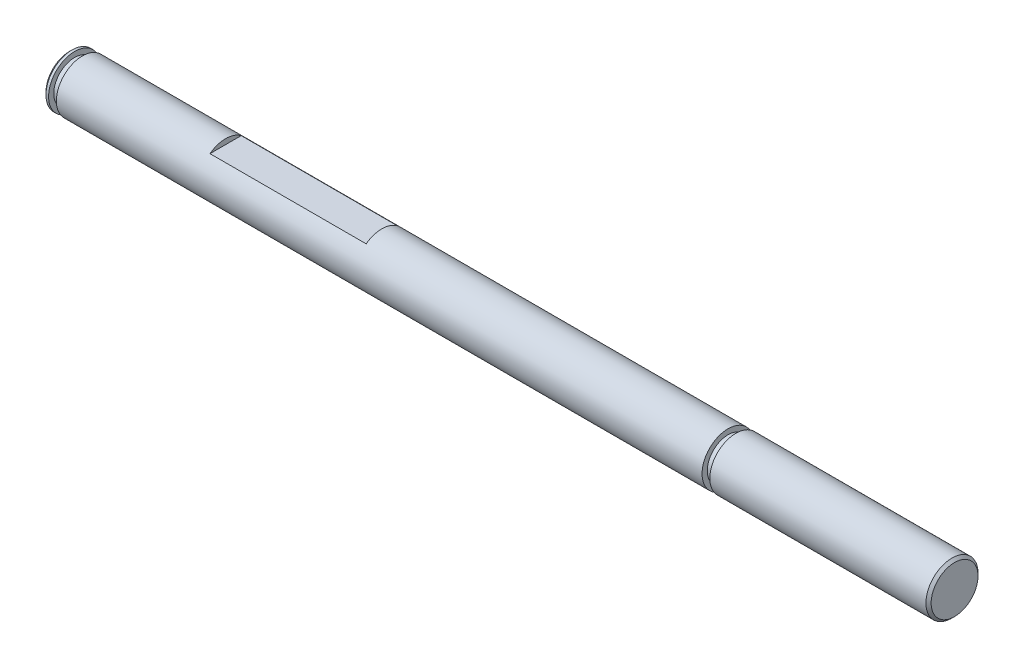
ISO-10303-21;
HEADER;
FILE_DESCRIPTION(('STEP AP214'),'2;1');
FILE_NAME('part.step','',(''),(''),'','','');
FILE_SCHEMA(('AUTOMOTIVE_DESIGN { 1 0 10303 214 1 1 1 1 }'));
ENDSEC;
DATA;
#1=APPLICATION_CONTEXT('core data for automotive mechanical design processes');
#2=APPLICATION_PROTOCOL_DEFINITION('international standard','automotive_design',2000,#1);
#3=PRODUCT_CONTEXT('',#1,'mechanical');
#4=PRODUCT('Part','Part','',(#3));
#5=PRODUCT_RELATED_PRODUCT_CATEGORY('part','',(#4));
#6=PRODUCT_DEFINITION_FORMATION('','',#4);
#7=PRODUCT_DEFINITION_CONTEXT('part definition',#1,'design');
#8=PRODUCT_DEFINITION('design','',#6,#7);
#9=PRODUCT_DEFINITION_SHAPE('','',#8);
#10=(LENGTH_UNIT() NAMED_UNIT(*) SI_UNIT(.MILLI.,.METRE.));
#11=(NAMED_UNIT(*) PLANE_ANGLE_UNIT() SI_UNIT($,.RADIAN.));
#12=(NAMED_UNIT(*) SI_UNIT($,.STERADIAN.) SOLID_ANGLE_UNIT());
#13=UNCERTAINTY_MEASURE_WITH_UNIT(LENGTH_MEASURE(1.E-05),#10,'distance_accuracy_value','');
#14=(GEOMETRIC_REPRESENTATION_CONTEXT(3) GLOBAL_UNCERTAINTY_ASSIGNED_CONTEXT((#13)) GLOBAL_UNIT_ASSIGNED_CONTEXT((#10,
#11,#12)) REPRESENTATION_CONTEXT('',''));
#15=CARTESIAN_POINT('',(0.,0.,0.));
#16=DIRECTION('',(0.,0.,1.));
#17=DIRECTION('',(1.,0.,0.));
#18=AXIS2_PLACEMENT_3D('',#15,#16,#17);
#19=CARTESIAN_POINT('',(85.,0.,0.));
#20=DIRECTION('',(-1.,0.,0.));
#21=DIRECTION('',(0.,0.,1.));
#22=AXIS2_PLACEMENT_3D('',#19,#20,#21);
#23=CYLINDRICAL_SURFACE('',#22,2.5);
#24=CARTESIAN_POINT('',(30.,0.,0.));
#25=DIRECTION('',(1.,0.,0.));
#26=DIRECTION('',(0.,0.,-1.));
#27=AXIS2_PLACEMENT_3D('',#24,#25,#26);
#28=CIRCLE('',#27,2.5);
#29=CARTESIAN_POINT('',(30.,2.,-1.5));
#30=VERTEX_POINT('',#29);
#31=CARTESIAN_POINT('',(30.,2.,1.5));
#32=VERTEX_POINT('',#31);
#33=EDGE_CURVE('E54',#30,#32,#28,.T.);
#34=ORIENTED_EDGE('',*,*,#33,.T.);
#35=DIRECTION('',(-1.,0.,0.));
#36=VECTOR('',#35,1.);
#37=CARTESIAN_POINT('',(85.,2.,1.5));
#38=LINE('',#37,#36);
#39=CARTESIAN_POINT('',(15.,2.,1.5));
#40=VERTEX_POINT('',#39);
#41=EDGE_CURVE('E72',#32,#40,#38,.T.);
#42=ORIENTED_EDGE('',*,*,#41,.T.);
#43=CARTESIAN_POINT('',(15.,0.,0.));
#44=DIRECTION('',(-1.,0.,0.));
#45=DIRECTION('',(0.,0.,1.));
#46=AXIS2_PLACEMENT_3D('',#43,#44,#45);
#47=CIRCLE('',#46,2.5);
#48=CARTESIAN_POINT('',(15.,2.,-1.5));
#49=VERTEX_POINT('',#48);
#50=EDGE_CURVE('E69',#40,#49,#47,.T.);
#51=ORIENTED_EDGE('',*,*,#50,.T.);
#52=DIRECTION('',(-1.,0.,0.));
#53=VECTOR('',#52,1.);
#54=CARTESIAN_POINT('',(85.,2.,-1.5));
#55=LINE('',#54,#53);
#56=EDGE_CURVE('E60',#49,#30,#55,.F.);
#57=ORIENTED_EDGE('',*,*,#56,.T.);
#58=EDGE_LOOP('',(#34,#42,#51,#57));
#59=FACE_BOUND('',#58,.T.);
#60=CARTESIAN_POINT('',(63.25,0.,0.));
#61=DIRECTION('',(1.,0.,0.));
#62=DIRECTION('',(0.,0.,-1.));
#63=AXIS2_PLACEMENT_3D('',#60,#61,#62);
#64=CIRCLE('',#63,2.5);
#65=CARTESIAN_POINT('',(63.25,0.,-2.5));
#66=VERTEX_POINT('',#65);
#67=EDGE_CURVE('E114',#66,#66,#64,.T.);
#68=ORIENTED_EDGE('',*,*,#67,.F.);
#69=EDGE_LOOP('',(#68));
#70=FACE_BOUND('',#69,.T.);
#71=CARTESIAN_POINT('',(1.25,0.,0.));
#72=DIRECTION('',(1.,0.,0.));
#73=DIRECTION('',(0.,0.,-1.));
#74=AXIS2_PLACEMENT_3D('',#71,#72,#73);
#75=CIRCLE('',#74,2.5);
#76=CARTESIAN_POINT('',(1.25,0.,-2.5));
#77=VERTEX_POINT('',#76);
#78=EDGE_CURVE('E127',#77,#77,#75,.T.);
#79=ORIENTED_EDGE('',*,*,#78,.T.);
#80=EDGE_LOOP('',(#79));
#81=FACE_BOUND('',#80,.T.);
#82=ADVANCED_FACE('F32',(#59,#70,#81),#23,.T.);
#83=CARTESIAN_POINT('',(0.5,0.,0.));
#84=DIRECTION('',(1.,0.,0.));
#85=DIRECTION('',(0.,0.,-1.));
#86=AXIS2_PLACEMENT_3D('',#83,#84,#85);
#87=CIRCLE('',#86,2.5);
#88=CARTESIAN_POINT('',(0.5,0.,-2.5));
#89=VERTEX_POINT('',#88);
#90=EDGE_CURVE('E124',#89,#89,#87,.T.);
#91=ORIENTED_EDGE('',*,*,#90,.F.);
#92=EDGE_LOOP('',(#91));
#93=FACE_BOUND('',#92,.T.);
#94=CARTESIAN_POINT('',(0.25,0.,0.));
#95=DIRECTION('',(1.,0.,0.));
#96=DIRECTION('',(0.,0.,-1.));
#97=AXIS2_PLACEMENT_3D('',#94,#95,#96);
#98=CIRCLE('',#97,2.5);
#99=CARTESIAN_POINT('',(0.25,0.,-2.5));
#100=VERTEX_POINT('',#99);
#101=EDGE_CURVE('E136',#100,#100,#98,.T.);
#102=ORIENTED_EDGE('',*,*,#101,.T.);
#103=EDGE_LOOP('',(#102));
#104=FACE_BOUND('',#103,.T.);
#105=ADVANCED_FACE('F90',(#93,#104),#23,.T.);
#106=CARTESIAN_POINT('',(0.,0.,0.));
#107=DIRECTION('',(1.,0.,0.));
#108=DIRECTION('',(0.,0.,-1.));
#109=AXIS2_PLACEMENT_3D('',#106,#107,#108);
#110=PLANE('',#109);
#111=CARTESIAN_POINT('',(0.,0.,0.));
#112=DIRECTION('',(1.,0.,0.));
#113=DIRECTION('',(0.,0.,-1.));
#114=AXIS2_PLACEMENT_3D('',#111,#112,#113);
#115=CIRCLE('',#114,2.25);
#116=CARTESIAN_POINT('',(0.,0.,-2.25));
#117=VERTEX_POINT('',#116);
#118=EDGE_CURVE('E65',#117,#117,#115,.F.);
#119=ORIENTED_EDGE('',*,*,#118,.T.);
#120=EDGE_LOOP('',(#119));
#121=FACE_BOUND('',#120,.T.);
#122=ADVANCED_FACE('F96',(#121),#110,.F.);
#123=CARTESIAN_POINT('',(0.25,0.,0.));
#124=DIRECTION('',(1.,0.,0.));
#125=DIRECTION('',(0.,0.,-1.));
#126=AXIS2_PLACEMENT_3D('',#123,#124,#125);
#127=CONICAL_SURFACE('',#126,2.5,0.785398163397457);
#128=ORIENTED_EDGE('',*,*,#118,.F.);
#129=EDGE_LOOP('',(#128));
#130=FACE_BOUND('',#129,.T.);
#131=ORIENTED_EDGE('',*,*,#101,.F.);
#132=EDGE_LOOP('',(#131));
#133=FACE_BOUND('',#132,.T.);
#134=ADVANCED_FACE('F143',(#130,#133),#127,.T.);
#135=CARTESIAN_POINT('',(0.5,2.5,0.));
#136=DIRECTION('',(-1.,0.,0.));
#137=DIRECTION('',(0.,0.,1.));
#138=AXIS2_PLACEMENT_3D('',#135,#136,#137);
#139=PLANE('',#138);
#140=CARTESIAN_POINT('',(0.5,0.,0.));
#141=DIRECTION('',(1.,0.,0.));
#142=DIRECTION('',(0.,0.,-1.));
#143=AXIS2_PLACEMENT_3D('',#140,#141,#142);
#144=CIRCLE('',#143,2.);
#145=CARTESIAN_POINT('',(0.5,0.,-2.));
#146=VERTEX_POINT('',#145);
#147=EDGE_CURVE('E133',#146,#146,#144,.T.);
#148=ORIENTED_EDGE('',*,*,#147,.F.);
#149=EDGE_LOOP('',(#148));
#150=FACE_BOUND('',#149,.T.);
#151=ORIENTED_EDGE('',*,*,#90,.T.);
#152=EDGE_LOOP('',(#151));
#153=FACE_BOUND('',#152,.T.);
#154=ADVANCED_FACE('F146',(#150,#153),#139,.F.);
#155=CARTESIAN_POINT('',(-0.24761327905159,0.,0.));
#156=DIRECTION('',(1.,0.,0.));
#157=DIRECTION('',(0.,0.,-1.));
#158=AXIS2_PLACEMENT_3D('',#155,#156,#157);
#159=CYLINDRICAL_SURFACE('',#158,2.);
#160=CARTESIAN_POINT('',(1.25,0.,0.));
#161=DIRECTION('',(1.,0.,0.));
#162=DIRECTION('',(0.,0.,-1.));
#163=AXIS2_PLACEMENT_3D('',#160,#161,#162);
#164=CIRCLE('',#163,2.);
#165=CARTESIAN_POINT('',(1.25,0.,-2.));
#166=VERTEX_POINT('',#165);
#167=EDGE_CURVE('E130',#166,#166,#164,.T.);
#168=ORIENTED_EDGE('',*,*,#167,.F.);
#169=EDGE_LOOP('',(#168));
#170=FACE_BOUND('',#169,.T.);
#171=ORIENTED_EDGE('',*,*,#147,.T.);
#172=EDGE_LOOP('',(#171));
#173=FACE_BOUND('',#172,.T.);
#174=ADVANCED_FACE('F153',(#170,#173),#159,.T.);
#175=CARTESIAN_POINT('',(1.25,2.5,0.));
#176=DIRECTION('',(1.,0.,0.));
#177=DIRECTION('',(0.,0.,-1.));
#178=AXIS2_PLACEMENT_3D('',#175,#176,#177);
#179=PLANE('',#178);
#180=ORIENTED_EDGE('',*,*,#78,.F.);
#181=EDGE_LOOP('',(#180));
#182=FACE_BOUND('',#181,.T.);
#183=ORIENTED_EDGE('',*,*,#167,.T.);
#184=EDGE_LOOP('',(#183));
#185=FACE_BOUND('',#184,.T.);
#186=ADVANCED_FACE('F161',(#182,#185),#179,.F.);
#187=CARTESIAN_POINT('',(63.25,2.5,0.));
#188=DIRECTION('',(-1.,0.,0.));
#189=DIRECTION('',(0.,0.,1.));
#190=AXIS2_PLACEMENT_3D('',#187,#188,#189);
#191=PLANE('',#190);
#192=CARTESIAN_POINT('',(63.25,0.,0.));
#193=DIRECTION('',(1.,0.,0.));
#194=DIRECTION('',(0.,0.,-1.));
#195=AXIS2_PLACEMENT_3D('',#192,#193,#194);
#196=CIRCLE('',#195,2.);
#197=CARTESIAN_POINT('',(63.25,0.,-2.));
#198=VERTEX_POINT('',#197);
#199=EDGE_CURVE('E117',#198,#198,#196,.T.);
#200=ORIENTED_EDGE('',*,*,#199,.F.);
#201=EDGE_LOOP('',(#200));
#202=FACE_BOUND('',#201,.T.);
#203=ORIENTED_EDGE('',*,*,#67,.T.);
#204=EDGE_LOOP('',(#203));
#205=FACE_BOUND('',#204,.T.);
#206=ADVANCED_FACE('F165',(#202,#205),#191,.F.);
#207=CARTESIAN_POINT('',(-0.24761327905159,0.,0.));
#208=DIRECTION('',(1.,0.,0.));
#209=DIRECTION('',(0.,0.,-1.));
#210=AXIS2_PLACEMENT_3D('',#207,#208,#209);
#211=CYLINDRICAL_SURFACE('',#210,2.);
#212=CARTESIAN_POINT('',(64.,0.,0.));
#213=DIRECTION('',(1.,0.,0.));
#214=DIRECTION('',(0.,0.,-1.));
#215=AXIS2_PLACEMENT_3D('',#212,#213,#214);
#216=CIRCLE('',#215,2.);
#217=CARTESIAN_POINT('',(64.,0.,-2.));
#218=VERTEX_POINT('',#217);
#219=EDGE_CURVE('E113',#218,#218,#216,.T.);
#220=ORIENTED_EDGE('',*,*,#219,.F.);
#221=EDGE_LOOP('',(#220));
#222=FACE_BOUND('',#221,.T.);
#223=ORIENTED_EDGE('',*,*,#199,.T.);
#224=EDGE_LOOP('',(#223));
#225=FACE_BOUND('',#224,.T.);
#226=ADVANCED_FACE('F169',(#222,#225),#211,.T.);
#227=CARTESIAN_POINT('',(64.,2.5,0.));
#228=DIRECTION('',(1.,0.,0.));
#229=DIRECTION('',(0.,0.,-1.));
#230=AXIS2_PLACEMENT_3D('',#227,#228,#229);
#231=PLANE('',#230);
#232=CARTESIAN_POINT('',(64.,0.,0.));
#233=DIRECTION('',(1.,0.,0.));
#234=DIRECTION('',(0.,0.,-1.));
#235=AXIS2_PLACEMENT_3D('',#232,#233,#234);
#236=CIRCLE('',#235,2.5);
#237=CARTESIAN_POINT('',(64.,0.,-2.5));
#238=VERTEX_POINT('',#237);
#239=EDGE_CURVE('E111',#238,#238,#236,.T.);
#240=ORIENTED_EDGE('',*,*,#239,.F.);
#241=EDGE_LOOP('',(#240));
#242=FACE_BOUND('',#241,.T.);
#243=ORIENTED_EDGE('',*,*,#219,.T.);
#244=EDGE_LOOP('',(#243));
#245=FACE_BOUND('',#244,.T.);
#246=ADVANCED_FACE('F106',(#242,#245),#231,.F.);
#247=CARTESIAN_POINT('',(85.,0.,0.));
#248=DIRECTION('',(1.,0.,0.));
#249=DIRECTION('',(0.,0.,-1.));
#250=AXIS2_PLACEMENT_3D('',#247,#248,#249);
#251=PLANE('',#250);
#252=CARTESIAN_POINT('',(85.,0.,0.));
#253=DIRECTION('',(1.,0.,0.));
#254=DIRECTION('',(0.,0.,-1.));
#255=AXIS2_PLACEMENT_3D('',#252,#253,#254);
#256=CIRCLE('',#255,2.25000000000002);
#257=CARTESIAN_POINT('',(85.,0.,-2.25000000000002));
#258=VERTEX_POINT('',#257);
#259=EDGE_CURVE('E40',#258,#258,#256,.T.);
#260=ORIENTED_EDGE('',*,*,#259,.T.);
#261=EDGE_LOOP('',(#260));
#262=FACE_BOUND('',#261,.T.);
#263=ADVANCED_FACE('F79',(#262),#251,.T.);
#264=CARTESIAN_POINT('',(84.75,0.,0.));
#265=DIRECTION('',(1.,0.,0.));
#266=DIRECTION('',(0.,0.,-1.));
#267=AXIS2_PLACEMENT_3D('',#264,#265,#266);
#268=CIRCLE('',#267,2.5);
#269=CARTESIAN_POINT('',(84.75,0.,-2.5));
#270=VERTEX_POINT('',#269);
#271=EDGE_CURVE('E11',#270,#270,#268,.F.);
#272=ORIENTED_EDGE('',*,*,#271,.T.);
#273=EDGE_LOOP('',(#272));
#274=FACE_BOUND('',#273,.T.);
#275=ORIENTED_EDGE('',*,*,#239,.T.);
#276=EDGE_LOOP('',(#275));
#277=FACE_BOUND('',#276,.T.);
#278=ADVANCED_FACE('F92',(#274,#277),#23,.T.);
#279=CARTESIAN_POINT('',(15.,2.5,-5.));
#280=DIRECTION('',(-1.,0.,0.));
#281=DIRECTION('',(0.,0.,1.));
#282=AXIS2_PLACEMENT_3D('',#279,#280,#281);
#283=PLANE('',#282);
#284=DIRECTION('',(0.,0.,1.));
#285=VECTOR('',#284,1.);
#286=CARTESIAN_POINT('',(15.,2.,-5.));
#287=LINE('',#286,#285);
#288=EDGE_CURVE('E63',#49,#40,#287,.T.);
#289=ORIENTED_EDGE('',*,*,#288,.F.);
#290=ORIENTED_EDGE('',*,*,#50,.F.);
#291=EDGE_LOOP('',(#289,#290));
#292=FACE_BOUND('',#291,.T.);
#293=ADVANCED_FACE('F68',(#292),#283,.F.);
#294=CARTESIAN_POINT('',(30.,2.5,-5.));
#295=DIRECTION('',(1.,0.,0.));
#296=DIRECTION('',(0.,0.,-1.));
#297=AXIS2_PLACEMENT_3D('',#294,#295,#296);
#298=PLANE('',#297);
#299=DIRECTION('',(0.,0.,1.));
#300=VECTOR('',#299,1.);
#301=CARTESIAN_POINT('',(30.,2.,-5.));
#302=LINE('',#301,#300);
#303=EDGE_CURVE('E47',#30,#32,#302,.T.);
#304=ORIENTED_EDGE('',*,*,#303,.T.);
#305=ORIENTED_EDGE('',*,*,#33,.F.);
#306=EDGE_LOOP('',(#304,#305));
#307=FACE_BOUND('',#306,.T.);
#308=ADVANCED_FACE('F86',(#307),#298,.F.);
#309=CARTESIAN_POINT('',(15.,2.,-5.));
#310=DIRECTION('',(0.,-1.,0.));
#311=DIRECTION('',(0.,0.,-1.));
#312=AXIS2_PLACEMENT_3D('',#309,#310,#311);
#313=PLANE('',#312);
#314=ORIENTED_EDGE('',*,*,#303,.F.);
#315=ORIENTED_EDGE('',*,*,#56,.F.);
#316=ORIENTED_EDGE('',*,*,#288,.T.);
#317=ORIENTED_EDGE('',*,*,#41,.F.);
#318=EDGE_LOOP('',(#314,#315,#316,#317));
#319=FACE_BOUND('',#318,.T.);
#320=ADVANCED_FACE('F62',(#319),#313,.F.);
#321=CARTESIAN_POINT('',(85.,0.,0.));
#322=DIRECTION('',(-1.,0.,0.));
#323=DIRECTION('',(0.,0.,1.));
#324=AXIS2_PLACEMENT_3D('',#321,#322,#323);
#325=CONICAL_SURFACE('',#324,2.25000000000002,0.785398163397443);
#326=ORIENTED_EDGE('',*,*,#271,.F.);
#327=EDGE_LOOP('',(#326));
#328=FACE_BOUND('',#327,.T.);
#329=ORIENTED_EDGE('',*,*,#259,.F.);
#330=EDGE_LOOP('',(#329));
#331=FACE_BOUND('',#330,.T.);
#332=ADVANCED_FACE('F34',(#328,#331),#325,.T.);
#333=CLOSED_SHELL('',(#82,#105,#122,#134,#154,#174,#186,#206,#226,#246,#263,#278,#293,#308,#320,#332));
#334=MANIFOLD_SOLID_BREP('B2',#333);
#335=ADVANCED_BREP_SHAPE_REPRESENTATION('',(#18,#334),#14);
#336=SHAPE_DEFINITION_REPRESENTATION(#9,#335);
ENDSEC;
END-ISO-10303-21;
